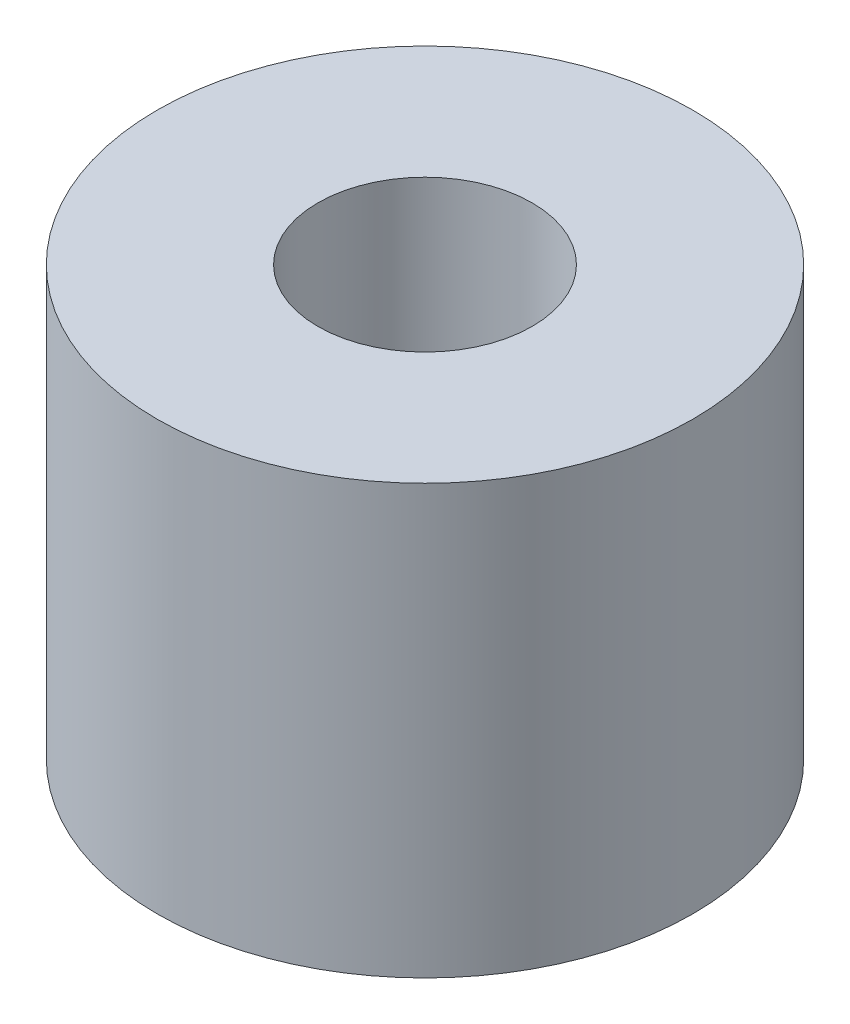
ISO-10303-21;
HEADER;
FILE_DESCRIPTION(('STEP AP214'),'2;1');
FILE_NAME('part.step','',(''),(''),'','','');
FILE_SCHEMA(('AUTOMOTIVE_DESIGN { 1 0 10303 214 1 1 1 1 }'));
ENDSEC;
DATA;
#1=APPLICATION_CONTEXT('core data for automotive mechanical design processes');
#2=APPLICATION_PROTOCOL_DEFINITION('international standard','automotive_design',2000,#1);
#3=PRODUCT_CONTEXT('',#1,'mechanical');
#4=PRODUCT('Part','Part','',(#3));
#5=PRODUCT_RELATED_PRODUCT_CATEGORY('part','',(#4));
#6=PRODUCT_DEFINITION_FORMATION('','',#4);
#7=PRODUCT_DEFINITION_CONTEXT('part definition',#1,'design');
#8=PRODUCT_DEFINITION('design','',#6,#7);
#9=PRODUCT_DEFINITION_SHAPE('','',#8);
#10=(LENGTH_UNIT() NAMED_UNIT(*) SI_UNIT(.MILLI.,.METRE.));
#11=(NAMED_UNIT(*) PLANE_ANGLE_UNIT() SI_UNIT($,.RADIAN.));
#12=(NAMED_UNIT(*) SI_UNIT($,.STERADIAN.) SOLID_ANGLE_UNIT());
#13=UNCERTAINTY_MEASURE_WITH_UNIT(LENGTH_MEASURE(1.E-05),#10,'distance_accuracy_value','');
#14=(GEOMETRIC_REPRESENTATION_CONTEXT(3) GLOBAL_UNCERTAINTY_ASSIGNED_CONTEXT((#13)) GLOBAL_UNIT_ASSIGNED_CONTEXT((#10,
#11,#12)) REPRESENTATION_CONTEXT('',''));
#15=CARTESIAN_POINT('',(0.,0.,0.));
#16=DIRECTION('',(0.,0.,1.));
#17=DIRECTION('',(1.,0.,0.));
#18=AXIS2_PLACEMENT_3D('',#15,#16,#17);
#19=CARTESIAN_POINT('',(0.,20.,0.));
#20=DIRECTION('',(0.,1.,0.));
#21=DIRECTION('',(0.,0.,1.));
#22=AXIS2_PLACEMENT_3D('',#19,#20,#21);
#23=PLANE('',#22);
#24=CARTESIAN_POINT('',(0.,20.,0.));
#25=DIRECTION('',(0.,1.,0.));
#26=DIRECTION('',(0.,0.,1.));
#27=AXIS2_PLACEMENT_3D('',#24,#25,#26);
#28=CIRCLE('',#27,12.5);
#29=CARTESIAN_POINT('',(0.,20.,12.5));
#30=VERTEX_POINT('',#29);
#31=EDGE_CURVE('E10',#30,#30,#28,.T.);
#32=ORIENTED_EDGE('',*,*,#31,.T.);
#33=EDGE_LOOP('',(#32));
#34=FACE_BOUND('',#33,.T.);
#35=CARTESIAN_POINT('',(0.,20.,0.));
#36=DIRECTION('',(0.,1.,0.));
#37=DIRECTION('',(0.,0.,1.));
#38=AXIS2_PLACEMENT_3D('',#35,#36,#37);
#39=CIRCLE('',#38,5.);
#40=CARTESIAN_POINT('',(0.,20.,5.));
#41=VERTEX_POINT('',#40);
#42=EDGE_CURVE('E49',#41,#41,#39,.T.);
#43=ORIENTED_EDGE('',*,*,#42,.F.);
#44=EDGE_LOOP('',(#43));
#45=FACE_BOUND('',#44,.T.);
#46=ADVANCED_FACE('F32',(#34,#45),#23,.T.);
#47=CARTESIAN_POINT('',(0.,0.,0.));
#48=DIRECTION('',(0.,1.,0.));
#49=DIRECTION('',(0.,0.,1.));
#50=AXIS2_PLACEMENT_3D('',#47,#48,#49);
#51=PLANE('',#50);
#52=CARTESIAN_POINT('',(0.,0.,0.));
#53=DIRECTION('',(0.,1.,0.));
#54=DIRECTION('',(0.,0.,1.));
#55=AXIS2_PLACEMENT_3D('',#52,#53,#54);
#56=CIRCLE('',#55,12.5);
#57=CARTESIAN_POINT('',(0.,0.,12.5));
#58=VERTEX_POINT('',#57);
#59=EDGE_CURVE('E45',#58,#58,#56,.T.);
#60=ORIENTED_EDGE('',*,*,#59,.F.);
#61=EDGE_LOOP('',(#60));
#62=FACE_BOUND('',#61,.T.);
#63=CARTESIAN_POINT('',(0.,0.,0.));
#64=DIRECTION('',(0.,1.,0.));
#65=DIRECTION('',(0.,0.,1.));
#66=AXIS2_PLACEMENT_3D('',#63,#64,#65);
#67=CIRCLE('',#66,5.);
#68=CARTESIAN_POINT('',(0.,0.,5.));
#69=VERTEX_POINT('',#68);
#70=EDGE_CURVE('E54',#69,#69,#67,.T.);
#71=ORIENTED_EDGE('',*,*,#70,.T.);
#72=EDGE_LOOP('',(#71));
#73=FACE_BOUND('',#72,.T.);
#74=ADVANCED_FACE('F71',(#62,#73),#51,.F.);
#75=CARTESIAN_POINT('',(0.,20.,0.));
#76=DIRECTION('',(0.,-1.,0.));
#77=DIRECTION('',(0.,0.,-1.));
#78=AXIS2_PLACEMENT_3D('',#75,#76,#77);
#79=CYLINDRICAL_SURFACE('',#78,12.5);
#80=CARTESIAN_POINT('',(0.,12.,-12.5));
#81=CARTESIAN_POINT('',(-0.111577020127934,11.9999954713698,-12.4999981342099));
#82=CARTESIAN_POINT('',(-0.223216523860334,11.9906313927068,-12.4984904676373));
#83=CARTESIAN_POINT('',(-0.443368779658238,11.953435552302,-12.4926212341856));
#84=CARTESIAN_POINT('',(-0.551878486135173,11.9255863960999,-12.4882569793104));
#85=CARTESIAN_POINT('',(-0.762553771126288,11.852279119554,-12.4771644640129));
#86=CARTESIAN_POINT('',(-0.864724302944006,11.8068349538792,-12.4704380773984));
#87=CARTESIAN_POINT('',(-1.05997584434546,11.6996632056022,-12.4553623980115));
#88=CARTESIAN_POINT('',(-1.15305798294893,11.6379376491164,-12.4470133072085));
#89=CARTESIAN_POINT('',(-1.32832749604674,11.4993743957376,-12.4295364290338));
#90=CARTESIAN_POINT('',(-1.41042286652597,11.4224210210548,-12.4204030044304));
#91=CARTESIAN_POINT('',(-1.56059410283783,11.255835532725,-12.4024303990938));
#92=CARTESIAN_POINT('',(-1.62866911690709,11.1662026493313,-12.393591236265));
#93=CARTESIAN_POINT('',(-1.74923165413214,10.9761761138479,-12.377153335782));
#94=CARTESIAN_POINT('',(-1.80162899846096,10.8757245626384,-12.369561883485));
#95=CARTESIAN_POINT('',(-1.88877230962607,10.6673043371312,-12.3565566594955));
#96=CARTESIAN_POINT('',(-1.92351937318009,10.5593361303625,-12.3511427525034));
#97=CARTESIAN_POINT('',(-1.97408758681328,10.3399196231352,-12.3431614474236));
#98=CARTESIAN_POINT('',(-1.990067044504,10.22850868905,-12.3405702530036));
#99=CARTESIAN_POINT('',(-2.00313711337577,10.0045590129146,-12.3384556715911));
#100=CARTESIAN_POINT('',(-2.00022895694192,9.89202034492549,-12.3389320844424));
#101=CARTESIAN_POINT('',(-1.97573547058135,9.67013496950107,-12.3428771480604));
#102=CARTESIAN_POINT('',(-1.95432734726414,9.56076812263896,-12.3463174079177));
#103=CARTESIAN_POINT('',(-1.8937194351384,9.34719892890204,-12.3557581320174));
#104=CARTESIAN_POINT('',(-1.85451907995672,9.2429967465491,-12.36175867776));
#105=CARTESIAN_POINT('',(-1.75925788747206,9.04218073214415,-12.375674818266));
#106=CARTESIAN_POINT('',(-1.70312285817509,8.94560270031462,-12.3835988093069));
#107=CARTESIAN_POINT('',(-1.57563852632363,8.76316972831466,-12.4004630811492));
#108=CARTESIAN_POINT('',(-1.50428809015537,8.67731558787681,-12.4094034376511));
#109=CARTESIAN_POINT('',(-1.34742984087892,8.51774119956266,-12.4274181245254));
#110=CARTESIAN_POINT('',(-1.26176985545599,8.44417049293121,-12.4364928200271));
#111=CARTESIAN_POINT('',(-1.07924037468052,8.31242526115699,-12.4536592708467));
#112=CARTESIAN_POINT('',(-0.982370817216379,8.25425082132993,-12.4617510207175));
#113=CARTESIAN_POINT('',(-0.780035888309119,8.15493832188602,-12.4760500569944));
#114=CARTESIAN_POINT('',(-0.674564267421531,8.11381278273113,-12.4822559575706));
#115=CARTESIAN_POINT('',(-0.45808983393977,8.04990064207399,-12.492072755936));
#116=CARTESIAN_POINT('',(-0.34708744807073,8.02711262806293,-12.4956838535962));
#117=CARTESIAN_POINT('',(-0.123992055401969,8.00072352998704,-12.4998774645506));
#118=CARTESIAN_POINT('',(-0.0119239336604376,7.99691703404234,-12.5004923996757));
#119=CARTESIAN_POINT('',(0.211249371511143,8.00805238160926,-12.4987129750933));
#120=CARTESIAN_POINT('',(0.322354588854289,8.02299356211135,-12.4963187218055));
#121=CARTESIAN_POINT('',(0.539818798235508,8.07102929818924,-12.4888100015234));
#122=CARTESIAN_POINT('',(0.646200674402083,8.10402282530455,-12.4837106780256));
#123=CARTESIAN_POINT('',(0.851922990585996,8.18711946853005,-12.4713614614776));
#124=CARTESIAN_POINT('',(0.951263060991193,8.23722348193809,-12.4641114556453));
#125=CARTESIAN_POINT('',(1.14097865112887,8.35359399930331,-12.4481852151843));
#126=CARTESIAN_POINT('',(1.2312740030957,8.41998963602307,-12.4394977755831));
#127=CARTESIAN_POINT('',(1.39951415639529,8.56688015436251,-12.4216959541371));
#128=CARTESIAN_POINT('',(1.47745813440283,8.64737597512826,-12.4125815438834));
#129=CARTESIAN_POINT('',(1.61953866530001,8.82110038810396,-12.3948490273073));
#130=CARTESIAN_POINT('',(1.6835368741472,8.91444277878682,-12.3862364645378));
#131=CARTESIAN_POINT('',(1.7949448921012,9.11067378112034,-12.3705841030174));
#132=CARTESIAN_POINT('',(1.84235519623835,9.2135621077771,-12.3635442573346));
#133=CARTESIAN_POINT('',(1.91903158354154,9.42556695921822,-12.3518754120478));
#134=CARTESIAN_POINT('',(1.94836814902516,9.53465745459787,-12.3472370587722));
#135=CARTESIAN_POINT('',(1.9882871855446,9.75629756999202,-12.3408723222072));
#136=CARTESIAN_POINT('',(1.99887114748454,9.86884691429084,-12.3391457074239));
#137=CARTESIAN_POINT('',(2.00094546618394,10.0928294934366,-12.3388093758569));
#138=CARTESIAN_POINT('',(1.99265347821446,10.2042607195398,-12.3401641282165));
#139=CARTESIAN_POINT('',(1.95768017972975,10.4241213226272,-12.3457602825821));
#140=CARTESIAN_POINT('',(1.93099891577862,10.5325507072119,-12.3500016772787));
#141=CARTESIAN_POINT('',(1.86008521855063,10.7432553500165,-12.3608801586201));
#142=CARTESIAN_POINT('',(1.81587007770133,10.8455365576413,-12.3675148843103));
#143=CARTESIAN_POINT('',(1.71116577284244,11.0412644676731,-12.3824349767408));
#144=CARTESIAN_POINT('',(1.65067590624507,11.1347107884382,-12.3907204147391));
#145=CARTESIAN_POINT('',(1.51435663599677,11.3112185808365,-12.4081216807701));
#146=CARTESIAN_POINT('',(1.43836664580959,11.3941552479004,-12.417245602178));
#147=CARTESIAN_POINT('',(1.27354334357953,11.5461753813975,-12.4352300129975));
#148=CARTESIAN_POINT('',(1.18470706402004,11.6152556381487,-12.44409044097));
#149=CARTESIAN_POINT('',(0.996048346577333,11.7379974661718,-12.4606140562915));
#150=CARTESIAN_POINT('',(0.896160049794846,11.7915588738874,-12.4682693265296));
#151=CARTESIAN_POINT('',(0.688725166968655,11.8810612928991,-12.4814428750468));
#152=CARTESIAN_POINT('',(0.581186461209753,11.917020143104,-12.4869633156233));
#153=CARTESIAN_POINT('',(0.394335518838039,11.9623457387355,-12.4940175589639));
#154=CARTESIAN_POINT('',(0.316163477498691,11.9764439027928,-12.4962491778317));
#155=CARTESIAN_POINT('',(0.158671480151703,11.9952725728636,-12.4992410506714));
#156=CARTESIAN_POINT('',(0.0793515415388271,12.0000032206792,-12.5000013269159));
#157=CARTESIAN_POINT('',(0.,12.,-12.5));
#158=B_SPLINE_CURVE_WITH_KNOTS('',3,(#80,#81,#82,#83,#84,#85,#86,#87,#88,#89,#90,#91,#92,#93,
#94,#95,#96,#97,#98,#99,#100,#101,#102,#103,#104,#105,#106,#107,#108,#109,#110,#111,#112,#113,
#114,#115,#116,#117,#118,#119,#120,#121,#122,#123,#124,#125,#126,#127,#128,#129,#130,#131,#132,
#133,#134,#135,#136,#137,#138,#139,#140,#141,#142,#143,#144,#145,#146,#147,#148,#149,#150,#151,
#152,#153,#154,#155,#156,#157),.UNSPECIFIED.,.T.,.F.,(4,2,2,2,2,2,2,2,2,2,2,2,2,2,2,2,2,2,2,2,2,
2,2,2,2,2,2,2,2,2,2,2,2,2,2,2,2,2,4),(0.,0.334441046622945,0.669197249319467,1.00368849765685,
1.33813814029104,1.67523334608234,2.0123490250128,2.35136809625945,2.69036609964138,
3.0264835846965,3.36257913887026,3.695490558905,4.02841257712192,4.36281487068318,
4.69724208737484,5.0354831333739,5.37372605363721,5.71221693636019,6.05068174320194,
6.38547572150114,6.72025786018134,7.05318530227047,7.38613020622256,7.72180459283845,
8.0575013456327,8.39639027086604,8.73526908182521,9.07281785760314,9.41033979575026,
9.74398956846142,10.0776384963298,10.4109591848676,10.7442942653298,11.0812763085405,
11.4183363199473,11.7575256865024,12.0963705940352,12.3342225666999,12.5720709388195),.UNSPECIFIED.);
#159=CARTESIAN_POINT('',(0.,12.,-12.5));
#160=VERTEX_POINT('',#159);
#161=EDGE_CURVE('E57',#160,#160,#158,.T.);
#162=ORIENTED_EDGE('',*,*,#161,.T.);
#163=EDGE_LOOP('',(#162));
#164=FACE_BOUND('',#163,.T.);
#165=ORIENTED_EDGE('',*,*,#31,.F.);
#166=EDGE_LOOP('',(#165));
#167=FACE_BOUND('',#166,.T.);
#168=ORIENTED_EDGE('',*,*,#59,.T.);
#169=EDGE_LOOP('',(#168));
#170=FACE_BOUND('',#169,.T.);
#171=ADVANCED_FACE('F34',(#164,#167,#170),#79,.T.);
#172=CARTESIAN_POINT('',(0.,20.,0.));
#173=DIRECTION('',(0.,-1.,0.));
#174=DIRECTION('',(0.,0.,-1.));
#175=AXIS2_PLACEMENT_3D('',#172,#173,#174);
#176=CYLINDRICAL_SURFACE('',#175,5.);
#177=CARTESIAN_POINT('',(0.,12.,-5.));
#178=CARTESIAN_POINT('',(-0.107493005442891,11.9999901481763,-4.99999271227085));
#179=CARTESIAN_POINT('',(-0.215172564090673,11.9912822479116,-4.99649294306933));
#180=CARTESIAN_POINT('',(-0.427496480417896,11.9567522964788,-4.98283453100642));
#181=CARTESIAN_POINT('',(-0.532131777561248,11.9308837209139,-4.97265778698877));
#182=CARTESIAN_POINT('',(-0.734953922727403,11.8631239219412,-4.94674209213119));
#183=CARTESIAN_POINT('',(-0.833160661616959,11.8212851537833,-4.93102136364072));
#184=CARTESIAN_POINT('',(-1.02107197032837,11.7229808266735,-4.89556610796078));
#185=CARTESIAN_POINT('',(-1.11077947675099,11.6665203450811,-4.87583297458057));
#186=CARTESIAN_POINT('',(-1.28350100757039,11.5377645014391,-4.83330886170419));
#187=CARTESIAN_POINT('',(-1.36606227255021,11.4648933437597,-4.81042296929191));
#188=CARTESIAN_POINT('',(-1.51817500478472,11.3065999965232,-4.76460576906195));
#189=CARTESIAN_POINT('',(-1.58772010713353,11.2211717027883,-4.74167444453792));
#190=CARTESIAN_POINT('',(-1.71487456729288,11.0355719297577,-4.69722791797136));
#191=CARTESIAN_POINT('',(-1.77181498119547,10.9349135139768,-4.67582115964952));
#192=CARTESIAN_POINT('',(-1.86775471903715,10.72446360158,-4.63833647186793));
#193=CARTESIAN_POINT('',(-1.90676256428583,10.6146764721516,-4.62225601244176));
#194=CARTESIAN_POINT('',(-1.96389882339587,10.3942876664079,-4.59826357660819));
#195=CARTESIAN_POINT('',(-1.98289396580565,10.2839487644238,-4.59001420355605));
#196=CARTESIAN_POINT('',(-2.00217296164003,10.0613650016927,-4.58164004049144));
#197=CARTESIAN_POINT('',(-2.00246601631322,9.94912110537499,-4.58151125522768));
#198=CARTESIAN_POINT('',(-1.98498936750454,9.73424332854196,-4.58910500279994));
#199=CARTESIAN_POINT('',(-1.96847531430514,9.63148428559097,-4.5962817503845));
#200=CARTESIAN_POINT('',(-1.91994688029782,9.43034044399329,-4.61676187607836));
#201=CARTESIAN_POINT('',(-1.88792979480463,9.33195641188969,-4.63006632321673));
#202=CARTESIAN_POINT('',(-1.80869473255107,9.13998216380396,-4.6615948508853));
#203=CARTESIAN_POINT('',(-1.76117986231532,9.04653076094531,-4.67991379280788));
#204=CARTESIAN_POINT('',(-1.65250646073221,8.86858418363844,-4.7193811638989));
#205=CARTESIAN_POINT('',(-1.59134280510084,8.78409239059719,-4.74053065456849));
#206=CARTESIAN_POINT('',(-1.45155059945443,8.619590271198,-4.78526736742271));
#207=CARTESIAN_POINT('',(-1.37193746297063,8.54043127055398,-4.80891664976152));
#208=CARTESIAN_POINT('',(-1.20031442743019,8.39631552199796,-4.85459824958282));
#209=CARTESIAN_POINT('',(-1.10830206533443,8.33136160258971,-4.87663024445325));
#210=CARTESIAN_POINT('',(-0.912077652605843,8.21638255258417,-4.91714681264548));
#211=CARTESIAN_POINT('',(-0.807660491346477,8.16667771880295,-4.93555270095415));
#212=CARTESIAN_POINT('',(-0.591023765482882,8.08583213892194,-4.96614828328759));
#213=CARTESIAN_POINT('',(-0.478808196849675,8.05468196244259,-4.97834113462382));
#214=CARTESIAN_POINT('',(-0.256895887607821,8.0135517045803,-4.99456139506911));
#215=CARTESIAN_POINT('',(-0.147443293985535,8.00242754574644,-4.99902945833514));
#216=CARTESIAN_POINT('',(0.0718453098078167,7.99828689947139,-5.00068478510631));
#217=CARTESIAN_POINT('',(0.181681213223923,8.00526571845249,-4.99787393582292));
#218=CARTESIAN_POINT('',(0.393432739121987,8.03629175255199,-4.98557567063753));
#219=CARTESIAN_POINT('',(0.495482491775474,8.05955798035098,-4.97639391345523));
#220=CARTESIAN_POINT('',(0.69413542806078,8.12143570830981,-4.952594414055));
#221=CARTESIAN_POINT('',(0.790737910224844,8.16004917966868,-4.93797597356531));
#222=CARTESIAN_POINT('',(0.979078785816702,8.25278493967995,-4.90416594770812));
#223=CARTESIAN_POINT('',(1.07057802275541,8.30734547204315,-4.88484815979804));
#224=CARTESIAN_POINT('',(1.24344359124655,8.42994032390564,-4.84373364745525));
#225=CARTESIAN_POINT('',(1.32480584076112,8.49798004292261,-4.82193593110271));
#226=CARTESIAN_POINT('',(1.48072304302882,8.65087001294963,-4.77645117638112));
#227=CARTESIAN_POINT('',(1.55447393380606,8.73653354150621,-4.75273441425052));
#228=CARTESIAN_POINT('',(1.68675119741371,8.91944008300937,-4.70741672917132));
#229=CARTESIAN_POINT('',(1.74527506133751,9.01668500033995,-4.68581615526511));
#230=CARTESIAN_POINT('',(1.84580750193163,9.2214616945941,-4.64714299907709));
#231=CARTESIAN_POINT('',(1.88765059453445,9.32908399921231,-4.63011630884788));
#232=CARTESIAN_POINT('',(1.9522962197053,9.55073365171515,-4.60323673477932));
#233=CARTESIAN_POINT('',(1.97511280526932,9.66475620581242,-4.59337855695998));
#234=CARTESIAN_POINT('',(1.9997156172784,9.88712790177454,-4.58271759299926));
#235=CARTESIAN_POINT('',(2.00289708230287,9.99529483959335,-4.58131421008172));
#236=CARTESIAN_POINT('',(1.99180315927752,10.2105448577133,-4.58614836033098));
#237=CARTESIAN_POINT('',(1.97752998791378,10.3176280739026,-4.59238492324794));
#238=CARTESIAN_POINT('',(1.93307136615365,10.523332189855,-4.61126649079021));
#239=CARTESIAN_POINT('',(1.90353749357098,10.622120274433,-4.62364831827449));
#240=CARTESIAN_POINT('',(1.83000544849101,10.8133786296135,-4.65324001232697));
#241=CARTESIAN_POINT('',(1.78600328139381,10.9058471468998,-4.67045121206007));
#242=CARTESIAN_POINT('',(1.68187276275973,11.0876096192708,-4.70898609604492));
#243=CARTESIAN_POINT('',(1.62096533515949,11.1764186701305,-4.73048882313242));
#244=CARTESIAN_POINT('',(1.4858921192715,11.3429933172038,-4.77463804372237));
#245=CARTESIAN_POINT('',(1.41172233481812,11.4207555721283,-4.79728488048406));
#246=CARTESIAN_POINT('',(1.24650550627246,11.5682028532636,-4.84293567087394));
#247=CARTESIAN_POINT('',(1.15467600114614,11.6370373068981,-4.86586757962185));
#248=CARTESIAN_POINT('',(0.95990032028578,11.7583370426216,-4.90800406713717));
#249=CARTESIAN_POINT('',(0.856949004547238,11.8107947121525,-4.92720691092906));
#250=CARTESIAN_POINT('',(0.644738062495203,11.8966222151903,-4.95939714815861));
#251=CARTESIAN_POINT('',(0.535631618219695,11.9303293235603,-4.97249363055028));
#252=CARTESIAN_POINT('',(0.31287654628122,11.9786391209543,-4.99144306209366));
#253=CARTESIAN_POINT('',(0.199243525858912,11.9933024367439,-4.99731899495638));
#254=CARTESIAN_POINT('',(0.0569122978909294,11.9993953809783,-4.99975899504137));
#255=CARTESIAN_POINT('',(0.0284626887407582,12.0000026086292,-5.00000192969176));
#256=CARTESIAN_POINT('',(0.,12.,-5.));
#257=B_SPLINE_CURVE_WITH_KNOTS('',3,(#177,#178,#179,#180,#181,#182,#183,#184,#185,#186,#187,
#188,#189,#190,#191,#192,#193,#194,#195,#196,#197,#198,#199,#200,#201,#202,#203,#204,#205,#206,
#207,#208,#209,#210,#211,#212,#213,#214,#215,#216,#217,#218,#219,#220,#221,#222,#223,#224,#225,
#226,#227,#228,#229,#230,#231,#232,#233,#234,#235,#236,#237,#238,#239,#240,#241,#242,#243,#244,
#245,#246,#247,#248,#249,#250,#251,#252,#253,#254,#255,#256),.UNSPECIFIED.,.T.,.F.,(4,2,2,2,2,2,
2,2,2,2,2,2,2,2,2,2,2,2,2,2,2,2,2,2,2,2,2,2,2,2,2,2,2,2,2,2,2,2,2,4),(0.,0.322402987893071,
0.645683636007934,0.967911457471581,1.29002753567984,1.62597381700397,1.96208394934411,
2.31315258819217,2.66405423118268,2.99904105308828,3.33386306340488,3.64538328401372,
3.95695787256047,4.27489126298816,4.59294421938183,4.93558349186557,5.27829092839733,
5.62776913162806,5.9770695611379,6.30569184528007,6.63422893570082,6.94800455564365,
7.26182048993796,7.58523513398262,7.90877959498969,8.25368474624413,8.59864669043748,
8.94695045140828,9.29499672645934,9.61799673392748,9.94095572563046,10.2511431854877,
10.5614163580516,10.8894546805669,11.2175920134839,11.5670042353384,11.9165786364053,
12.2596430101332,12.6016125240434,12.686980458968),.UNSPECIFIED.);
#258=CARTESIAN_POINT('',(0.,12.,-5.));
#259=VERTEX_POINT('',#258);
#260=EDGE_CURVE('E37',#259,#259,#257,.T.);
#261=ORIENTED_EDGE('',*,*,#260,.F.);
#262=EDGE_LOOP('',(#261));
#263=FACE_BOUND('',#262,.T.);
#264=ORIENTED_EDGE('',*,*,#42,.T.);
#265=EDGE_LOOP('',(#264));
#266=FACE_BOUND('',#265,.T.);
#267=ORIENTED_EDGE('',*,*,#70,.F.);
#268=EDGE_LOOP('',(#267));
#269=FACE_BOUND('',#268,.T.);
#270=ADVANCED_FACE('F64',(#263,#266,#269),#176,.F.);
#271=CARTESIAN_POINT('',(0.,10.,-20.));
#272=DIRECTION('',(0.,0.,1.));
#273=DIRECTION('',(1.,0.,0.));
#274=AXIS2_PLACEMENT_3D('',#271,#272,#273);
#275=CYLINDRICAL_SURFACE('',#274,2.);
#276=ORIENTED_EDGE('',*,*,#260,.T.);
#277=EDGE_LOOP('',(#276));
#278=FACE_BOUND('',#277,.T.);
#279=ORIENTED_EDGE('',*,*,#161,.F.);
#280=EDGE_LOOP('',(#279));
#281=FACE_BOUND('',#280,.T.);
#282=ADVANCED_FACE('F61',(#278,#281),#275,.F.);
#283=CLOSED_SHELL('',(#46,#74,#171,#270,#282));
#284=MANIFOLD_SOLID_BREP('B2',#283);
#285=ADVANCED_BREP_SHAPE_REPRESENTATION('',(#18,#284),#14);
#286=SHAPE_DEFINITION_REPRESENTATION(#9,#285);
ENDSEC;
END-ISO-10303-21;
